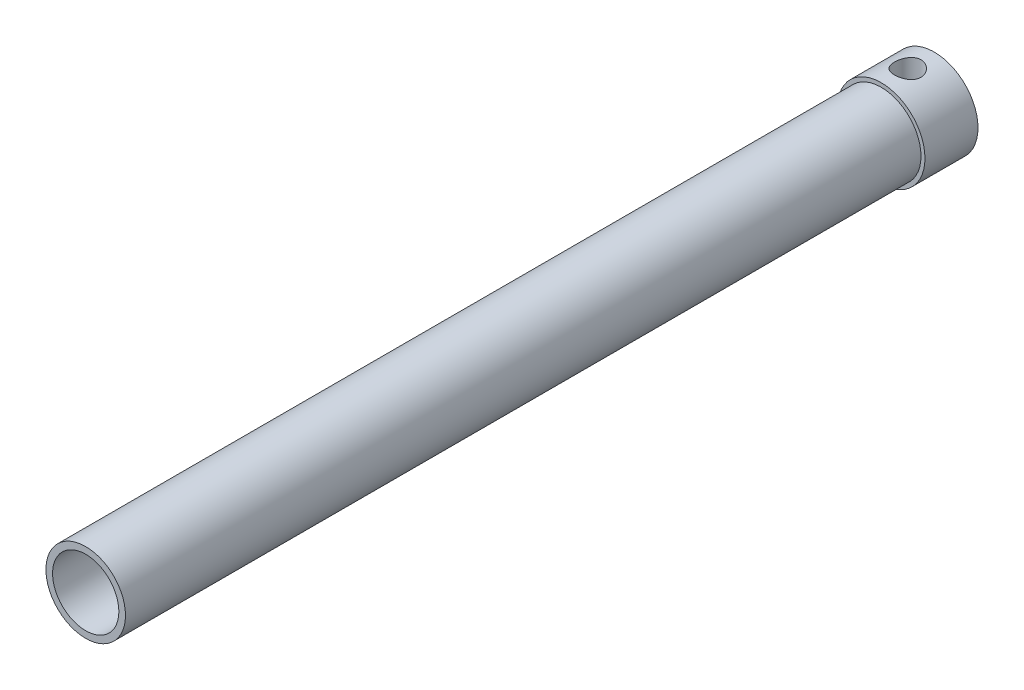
from build123d import *

# Parameters (mm, degrees)
SKETCH2_R           = 15
BOSS_EXTRUDE1_DEPTH = 300
SKETCH3_R           = 16.5
BOSS_EXTRUDE2_DEPTH = 20
SKETCH4_R           = 12.5
CUT_EXTRUDE1_DEPTH  = 75
SKETCH7_R           = 5
CUT_EXTRUDE2_DEPTH  = 17


with BuildPart() as part:
    # Sketch2 → Boss-Extrude1 (new body)
    with BuildSketch(Plane.XY):
        Circle(SKETCH2_R)
    extrude(amount=BOSS_EXTRUDE1_DEPTH)

    # Sketch3 → Boss-Extrude2 (add)
    with BuildSketch(Plane.XY):
        Circle(SKETCH3_R)
    extrude(amount=-BOSS_EXTRUDE2_DEPTH)

    # Sketch4 → Cut-Extrude1 (cut)
    with BuildSketch(Plane.XY.offset(300)):
        Circle(SKETCH4_R)
    extrude(amount=-CUT_EXTRUDE1_DEPTH, mode=Mode.SUBTRACT)

    # Sketch7 → Cut-Extrude2 (cut)
    with BuildSketch(Plane(origin=(0, 17, 0), x_dir=(1, 0, 0), z_dir=(0, 1, 0))):
        with Locations(Location((0, 10, 0), (0, 0, 270))):
            Circle(SKETCH7_R)
    extrude(amount=-CUT_EXTRUDE2_DEPTH, mode=Mode.SUBTRACT)


solid = part.part
